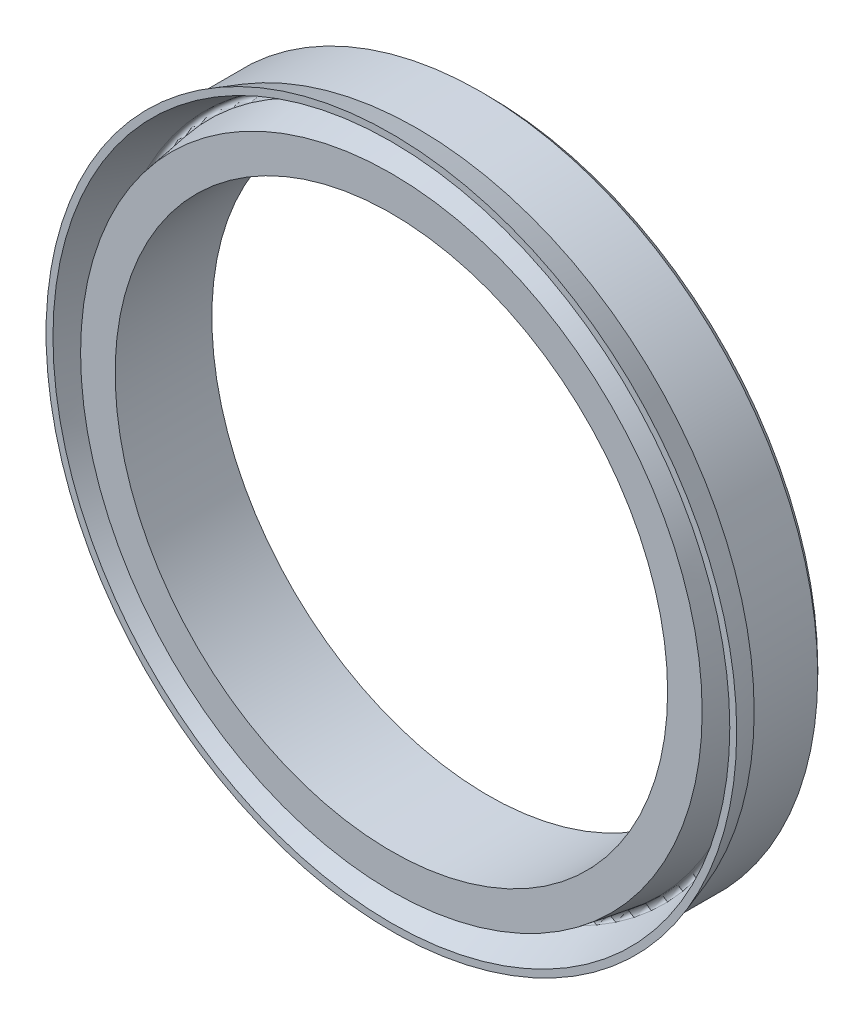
from build123d import *

# Parameters (mm, degrees)
CHANFREIN1_SIZE = 0.5


with BuildPart() as part:
    # Esquisse1 → Base-R_volution (revolve)
    with BuildSketch(Plane(origin=(0, 0, 0), x_dir=(0, 0, -1), z_dir=(1, 0, 0)), mode=Mode.PRIVATE) as base_r_volution_sk:
        with BuildLine():
            Line((0, 19.99879427), (0, 22.5))
            Line((0, 22.5), (3.079454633, 22.975642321))
            ThreePointArc((3.079454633, 22.975642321), (3.290406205, 23.201674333), (3.120349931, 23.459883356))
            Line((3.120349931, 23.459883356), (0, 24.5))
            Line((0, 24.5), (0, 25))
            Line((0, 25), (1.897366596, 24.367544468))
            Line((1.897366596, 24.367544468), (7, 24.367544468))
            Line((7, 24.367544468), (7, 19.99879427))
            Line((7, 19.99879427), (0, 19.99879427))
        make_face()
    revolve(base_r_volution_sk.sketch.rotate(Axis((0, 0, 20), (0, 0, -1)), 90), axis=Axis((0, 0, 20), (0, 0, -1)))

    # Chanfrein1
    chanfrein1_edges = [part.edges().sort_by_distance(p)[0] for p in [
        (-24.367544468, 0, -7),
    ]]
    chamfer(chanfrein1_edges, length=CHANFREIN1_SIZE)


solid = part.part
